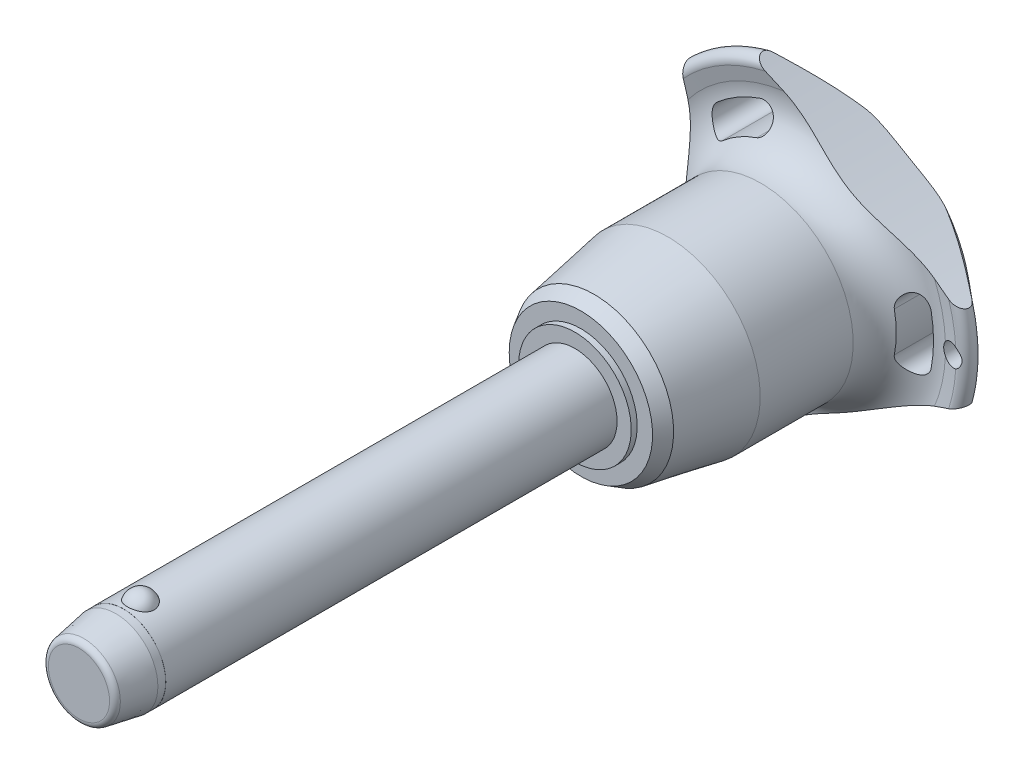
from build123d import *

# Parameters (mm, degrees)
SKETCH1_R           = 6
BOSS_EXTRUDE1_DEPTH = 60
SKETCH2_R           = 5.15
BOSS_EXTRUDE2_DEPTH = 39.7
BOSS_EXTRUDE3_START = 10.6
SKETCH1_2_R         = 6
BOSS_EXTRUDE3_DEPTH = 10.6
CHAMFER1_SIZE       = 5.3
CHAMFER1_SIZE2      = 0.934532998
FILLET1_R           = 0.85
SKETCH6_R           = 144.275
CUT_EXTRUDE1_DEPTH  = 106.231005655
CIRPATTERN1_COUNT   = 3
SKETCH7_R           = 1.5
CUT_EXTRUDE2_DEPTH  = 106.040118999
SKETCH8_R           = 6
SKETCH8_R_2         = 5.99
CUT_EXTRUDE3_DEPTH  = 6.36


with BuildPart() as part:
    # Sketch1 → Boss-Extrude1 (new body)
    with BuildSketch(Plane.XY):
        Circle(SKETCH1_R)
    extrude(amount=-BOSS_EXTRUDE1_DEPTH)

    # Sketch2 → Boss-Extrude2 (add)
    with BuildSketch(Plane(origin=(0, 0, -60), x_dir=(-1, 0, 0), z_dir=(0, 0, -1))):
        Circle(SKETCH2_R)
    extrude(amount=BOSS_EXTRUDE2_DEPTH)

    # Sketch3 → Revolve1 (revolve)
    with BuildSketch(Plane(origin=(0, 0, 0), x_dir=(0, 0, -1), z_dir=(1, 0, 0))):
        with BuildLine():
            Line((-1.854049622, 7.25), (-1.854049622, 3.25))
            ThreePointArc((-1.854049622, 3.25), (0.145950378, 5.25), (-1.854049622, 7.25))
        make_face()
        with BuildLine():
            Line((-1.854049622, -3.25), (-1.854049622, -7.25))
            ThreePointArc((-1.854049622, -7.25), (0.145950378, -5.25), (-1.854049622, -3.25))
        make_face()
    revolve(axis=Axis((0, -3.25, 1.854049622), (0, 1, 0)))

    # Sketch1_2 → Boss-Extrude3 (add)
    with BuildSketch(Plane.XY.offset(BOSS_EXTRUDE3_START)):
        Circle(SKETCH1_2_R)
    extrude(amount=-BOSS_EXTRUDE3_DEPTH)

    # Chamfer1
    chamfer1_edges = [part.edges().sort_by_distance(p)[0] for p in [
        (-6, 0, 10.6),
    ]]
    chamfer1_side = [part.faces().sort_by_distance(p)[0] for p in [
        (-6, 0, -24.7),
    ]]
    chamfer(chamfer1_edges, length=CHAMFER1_SIZE, length2=CHAMFER1_SIZE2, reference=chamfer1_side[0])

    # Fillet1
    fillet1_edges = [part.edges().sort_by_distance(p)[0] for p in [
        (-5.065467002, 0, 10.6),
        (5.15, 0, -99.7),
    ]]
    fillet(fillet1_edges, radius=FILLET1_R)

    # Sketch4 → Revolve2 (revolve)
    with BuildSketch(Plane(origin=(0, 0, 0), x_dir=(0, 0, -1), z_dir=(1, 0, 0)), mode=Mode.PRIVATE) as revolve2_sk:
        Polygon((60, 0), (60, 8.017240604), (60.85, 8.017240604), (60.85, 10.206249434), (62.745737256, 11.300753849), (73.233333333, 13.15), (86.466666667, 13.15), (86.466666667, 0), align=None)
    revolve(revolve2_sk.sketch.rotate(Axis((0, 0, -86.466666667), (0, 0, 1)), 90), axis=Axis((0, 0, -86.466666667), (0, 0, 1)))

    # Sketch5 → Revolve3 (revolve)
    with BuildSketch(Plane(origin=(0, 0, 0), x_dir=(0, 0, -1), z_dir=(1, 0, 0)), mode=Mode.PRIVATE) as revolve3_sk:
        with BuildLine():
            Line((92.32877039, 20.428960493), (91.910912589, 22.344207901))
            ThreePointArc((91.910912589, 22.344207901), (92.554394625, 23.677136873), (94.002586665, 23.371345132))
            Line((94.002586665, 23.371345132), (99.141488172, 17.247040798))
            ThreePointArc((99.141488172, 17.247040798), (99.7, 15.584758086), (98.978803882, 13.986322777))
            ThreePointArc((98.978803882, 13.986322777), (94.617427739, 7.589034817), (93.083333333, 0))
            Line((93.083333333, 0), (86.466666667, 0))
            Line((86.466666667, 0), (86.466666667, 13.15))
            ThreePointArc((86.466666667, 13.15), (91.139661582, 15.38660811), (92.32877039, 20.428960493))
        make_face()
    revolve(revolve3_sk.sketch.rotate(Axis((0, 0, -93.083333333), (0, 0, 1)), 90), axis=Axis((0, 0, -93.083333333), (0, 0, 1)))

    # Sketch6 → Cut-Extrude1 (cut, through all)
    with BuildSketch(Plane.XY):
        with Locations((-159.975, 0)):
            Circle(SKETCH6_R)
        with BuildLine():
            ThreePointArc((18.274208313, -3.515166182), (18.60922037, 0), (18.274208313, 3.515166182))
            ThreePointArc((18.274208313, 3.515166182), (16.143490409, 4.958408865), (14.700247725, 2.827690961))
            ThreePointArc((14.700247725, 2.827690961), (14.969740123, 0), (14.700247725, -2.827690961))
            ThreePointArc((14.700247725, -2.827690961), (16.143490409, -4.958408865), (18.274208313, -3.515166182))
        make_face()
    cut_extrude1 = extrude(amount=-CUT_EXTRUDE1_DEPTH, mode=Mode.SUBTRACT)

    # CirPattern1: Cut-Extrude1 ×3 about axis
    cirpattern1_axis = Axis((0, 0, 0), (0, 0, 1))
    for i in range(1, CIRPATTERN1_COUNT):
        add(cut_extrude1.rotate(cirpattern1_axis, i * 360 / CIRPATTERN1_COUNT), mode=Mode.SUBTRACT)

    # Sketch7 → Cut-Extrude2 (cut, through all)
    with BuildSketch(Plane.XY):
        with Locations(Location((21.60922037, 0, 0), (0, 0, 297.620773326))):
            Circle(SKETCH7_R)
    extrude(amount=-CUT_EXTRUDE2_DEPTH, mode=Mode.SUBTRACT)

    # Sketch8 → Cut-Extrude3 (cut)
    with BuildSketch(Plane.XY.offset(10.6)):
        Circle(SKETCH8_R)
        Circle(SKETCH8_R_2, mode=Mode.SUBTRACT)
    extrude(amount=-CUT_EXTRUDE3_DEPTH, mode=Mode.SUBTRACT)


solid = part.part
